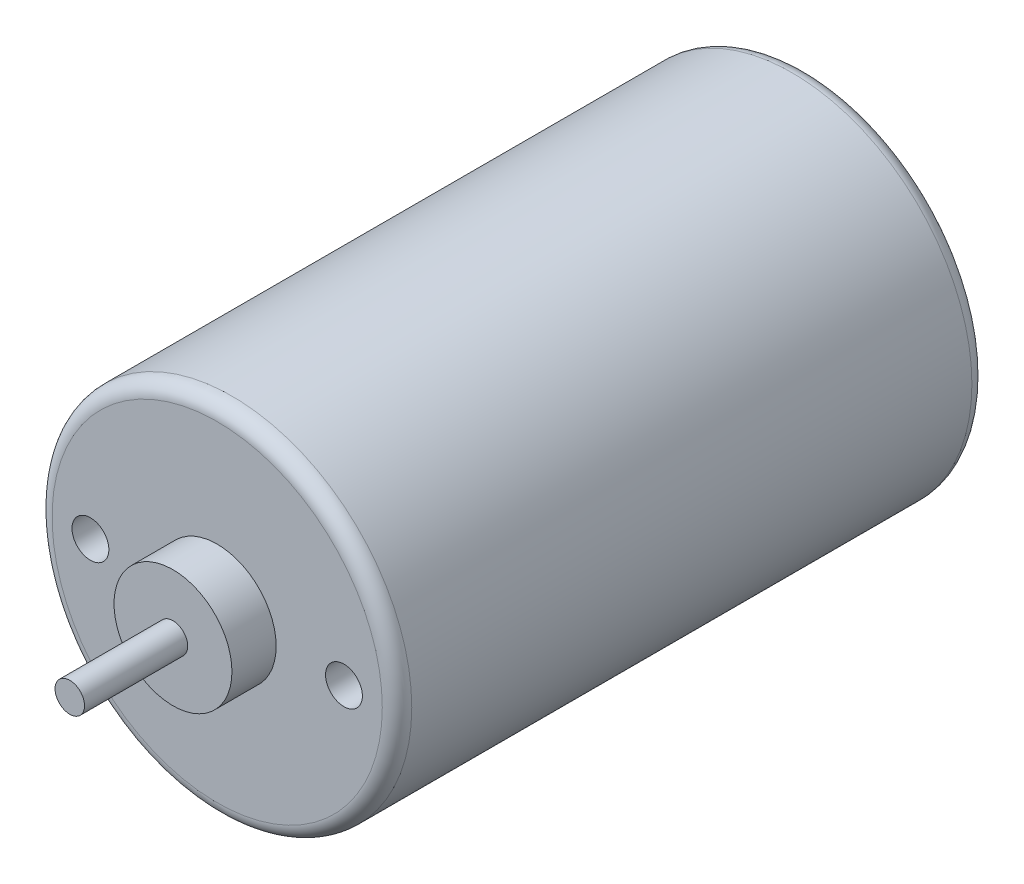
from build123d import *

# Parameters (mm, degrees)
ESBO_O1_R                                   = 12.2
RESSALTO_EXTRUS_O1_DEPTH                    = 40
ESBO_O2_R                                   = 4
RESSALTO_EXTRUS_O2_DEPTH                    = 3
ESBO_O3_R                                   = 1
RESSALTO_EXTRUS_O3_DEPTH                    = 7
BROCA_DE_ROSQUEAR_PARA_TARRAXA_DE_M31_D     = 2.5
BROCA_DE_ROSQUEAR_PARA_TARRAXA_DE_M31_DEPTH = 4
BROCA_DE_ROSQUEAR_PARA_TARRAXA_DE_M31_TIP   = 0.751075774
FILETE1_R                                   = 1
FILETE2_R                                   = 1


with BuildPart() as part:
    # Esbo_o1 → Ressalto-extrus_o1 (new body)
    with BuildSketch(Plane.XY):
        Circle(ESBO_O1_R)
    extrude(amount=RESSALTO_EXTRUS_O1_DEPTH)

    # Esbo_o2 → Ressalto-extrus_o2 (add)
    with BuildSketch(Plane.XY.offset(40)):
        Circle(ESBO_O2_R)
    extrude(amount=RESSALTO_EXTRUS_O2_DEPTH)

    # Esbo_o3 → Ressalto-extrus_o3 (add)
    with BuildSketch(Plane.XY.offset(43)):
        Circle(ESBO_O3_R)
    extrude(amount=RESSALTO_EXTRUS_O3_DEPTH)

    # Broca de rosquear para tarraxa de M31
    with Locations(Plane(origin=(-8.6, 0, 40), x_dir=(1, 0, 0), z_dir=(0, 0, 1))):
        with Locations((0, 0), (17.2, 0)):
            Hole(BROCA_DE_ROSQUEAR_PARA_TARRAXA_DE_M31_D / 2, depth=BROCA_DE_ROSQUEAR_PARA_TARRAXA_DE_M31_DEPTH)
            with Locations((0, 0, -(BROCA_DE_ROSQUEAR_PARA_TARRAXA_DE_M31_DEPTH + BROCA_DE_ROSQUEAR_PARA_TARRAXA_DE_M31_TIP / 2))):  # 118° drill point
                Cone(0, BROCA_DE_ROSQUEAR_PARA_TARRAXA_DE_M31_D / 2, BROCA_DE_ROSQUEAR_PARA_TARRAXA_DE_M31_TIP, mode=Mode.SUBTRACT)

    # Filete1
    filete1_edges = [part.edges().sort_by_distance(p)[0] for p in [
        (-12.2, 0, 40),
    ]]
    fillet(filete1_edges, radius=FILETE1_R)

    # Filete2
    filete2_edges = [part.edges().sort_by_distance(p)[0] for p in [
        (-12.2, 0, 0),
    ]]
    fillet(filete2_edges, radius=FILETE2_R)


solid = part.part
